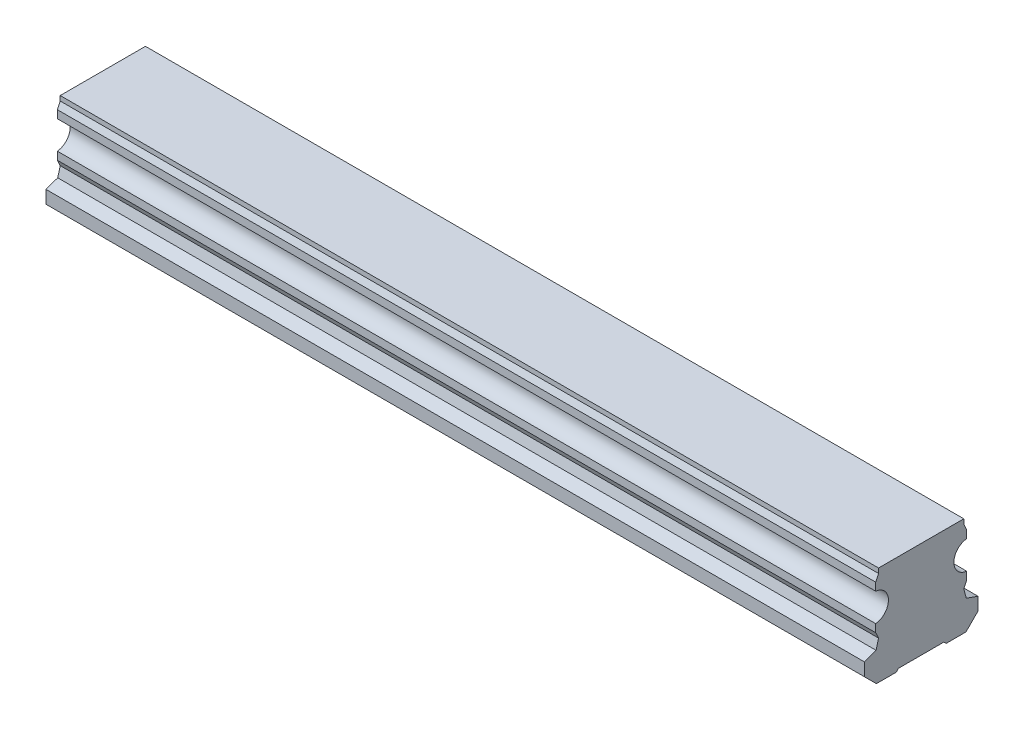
ISO-10303-21;
HEADER;
FILE_DESCRIPTION(('STEP AP214'),'2;1');
FILE_NAME('part.step','',(''),(''),'','','');
FILE_SCHEMA(('AUTOMOTIVE_DESIGN { 1 0 10303 214 1 1 1 1 }'));
ENDSEC;
DATA;
#1=APPLICATION_CONTEXT('core data for automotive mechanical design processes');
#2=APPLICATION_PROTOCOL_DEFINITION('international standard','automotive_design',2000,#1);
#3=PRODUCT_CONTEXT('',#1,'mechanical');
#4=PRODUCT('Part','Part','',(#3));
#5=PRODUCT_RELATED_PRODUCT_CATEGORY('part','',(#4));
#6=PRODUCT_DEFINITION_FORMATION('','',#4);
#7=PRODUCT_DEFINITION_CONTEXT('part definition',#1,'design');
#8=PRODUCT_DEFINITION('design','',#6,#7);
#9=PRODUCT_DEFINITION_SHAPE('','',#8);
#10=(LENGTH_UNIT() NAMED_UNIT(*) SI_UNIT(.MILLI.,.METRE.));
#11=(NAMED_UNIT(*) PLANE_ANGLE_UNIT() SI_UNIT($,.RADIAN.));
#12=(NAMED_UNIT(*) SI_UNIT($,.STERADIAN.) SOLID_ANGLE_UNIT());
#13=UNCERTAINTY_MEASURE_WITH_UNIT(LENGTH_MEASURE(1.E-05),#10,'distance_accuracy_value','');
#14=(GEOMETRIC_REPRESENTATION_CONTEXT(3) GLOBAL_UNCERTAINTY_ASSIGNED_CONTEXT((#13)) GLOBAL_UNIT_ASSIGNED_CONTEXT((#10,
#11,#12)) REPRESENTATION_CONTEXT('',''));
#15=CARTESIAN_POINT('',(0.,0.,0.));
#16=DIRECTION('',(0.,0.,1.));
#17=DIRECTION('',(1.,0.,0.));
#18=AXIS2_PLACEMENT_3D('',#15,#16,#17);
#19=CARTESIAN_POINT('',(150.,0.499999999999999,0.));
#20=DIRECTION('',(0.,-1.,0.));
#21=DIRECTION('',(0.,0.,-1.));
#22=AXIS2_PLACEMENT_3D('',#19,#20,#21);
#23=CONICAL_SURFACE('',#22,3.5,0.785398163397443);
#24=CARTESIAN_POINT('',(150.,1.00000000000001,0.));
#25=DIRECTION('',(0.,1.,0.));
#26=DIRECTION('',(0.,0.,1.));
#27=AXIS2_PLACEMENT_3D('',#24,#25,#26);
#28=CIRCLE('',#27,3.);
#29=CARTESIAN_POINT('',(150.,1.00000000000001,3.));
#30=VERTEX_POINT('',#29);
#31=EDGE_CURVE('E11',#30,#30,#28,.F.);
#32=ORIENTED_EDGE('',*,*,#31,.F.);
#33=EDGE_LOOP('',(#32));
#34=FACE_BOUND('',#33,.T.);
#35=CARTESIAN_POINT('',(150.,0.499999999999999,0.));
#36=DIRECTION('',(0.,1.,0.));
#37=DIRECTION('',(0.,0.,1.));
#38=AXIS2_PLACEMENT_3D('',#35,#36,#37);
#39=CIRCLE('',#38,3.5);
#40=CARTESIAN_POINT('',(150.,0.5,3.5));
#41=VERTEX_POINT('',#40);
#42=EDGE_CURVE('E433',#41,#41,#39,.T.);
#43=ORIENTED_EDGE('',*,*,#42,.F.);
#44=EDGE_LOOP('',(#43));
#45=FACE_BOUND('',#44,.T.);
#46=ADVANCED_FACE('F39',(#34,#45),#23,.F.);
#47=CARTESIAN_POINT('',(150.,12.,0.));
#48=DIRECTION('',(0.,-1.,0.));
#49=DIRECTION('',(0.,0.,-1.));
#50=AXIS2_PLACEMENT_3D('',#47,#48,#49);
#51=CYLINDRICAL_SURFACE('',#50,3.);
#52=ORIENTED_EDGE('',*,*,#31,.T.);
#53=EDGE_LOOP('',(#52));
#54=FACE_BOUND('',#53,.T.);
#55=CARTESIAN_POINT('',(150.,12.,0.));
#56=DIRECTION('',(0.,-1.,0.));
#57=DIRECTION('',(0.,0.,-1.));
#58=AXIS2_PLACEMENT_3D('',#55,#56,#57);
#59=CIRCLE('',#58,3.);
#60=CARTESIAN_POINT('',(150.,12.,-3.));
#61=VERTEX_POINT('',#60);
#62=EDGE_CURVE('E49',#61,#61,#59,.T.);
#63=ORIENTED_EDGE('',*,*,#62,.F.);
#64=EDGE_LOOP('',(#63));
#65=FACE_BOUND('',#64,.T.);
#66=ADVANCED_FACE('F573',(#54,#65),#51,.F.);
#67=CARTESIAN_POINT('',(150.,12.,0.));
#68=DIRECTION('',(0.,-1.,0.));
#69=DIRECTION('',(0.,0.,-1.));
#70=AXIS2_PLACEMENT_3D('',#67,#68,#69);
#71=PLANE('',#70);
#72=CARTESIAN_POINT('',(150.,12.,0.));
#73=DIRECTION('',(0.,-1.,0.));
#74=DIRECTION('',(0.,0.,-1.));
#75=AXIS2_PLACEMENT_3D('',#72,#73,#74);
#76=CIRCLE('',#75,2.5);
#77=CARTESIAN_POINT('',(150.,12.,-2.5));
#78=VERTEX_POINT('',#77);
#79=EDGE_CURVE('E42',#78,#78,#76,.T.);
#80=ORIENTED_EDGE('',*,*,#79,.F.);
#81=EDGE_LOOP('',(#80));
#82=FACE_BOUND('',#81,.T.);
#83=ORIENTED_EDGE('',*,*,#62,.T.);
#84=EDGE_LOOP('',(#83));
#85=FACE_BOUND('',#84,.T.);
#86=ADVANCED_FACE('F578',(#82,#85),#71,.T.);
#87=CARTESIAN_POINT('',(180.,21.8,-9.375));
#88=DIRECTION('',(0.,0.,1.));
#89=DIRECTION('',(0.,-1.,0.));
#90=AXIS2_PLACEMENT_3D('',#87,#88,#89);
#91=PLANE('',#90);
#92=DIRECTION('',(0.,1.,0.));
#93=VECTOR('',#92,1.);
#94=CARTESIAN_POINT('',(0.,21.8,-9.375));
#95=LINE('',#94,#93);
#96=CARTESIAN_POINT('',(0.,20.756,-9.375));
#97=VERTEX_POINT('',#96);
#98=CARTESIAN_POINT('',(0.,21.8,-9.375));
#99=VERTEX_POINT('',#98);
#100=EDGE_CURVE('E255',#97,#99,#95,.T.);
#101=ORIENTED_EDGE('',*,*,#100,.T.);
#102=DIRECTION('',(-1.,0.,0.));
#103=VECTOR('',#102,1.);
#104=CARTESIAN_POINT('',(180.,21.8,-9.375));
#105=LINE('',#104,#103);
#106=CARTESIAN_POINT('',(180.,21.8,-9.375));
#107=VERTEX_POINT('',#106);
#108=EDGE_CURVE('E423',#107,#99,#105,.T.);
#109=ORIENTED_EDGE('',*,*,#108,.F.);
#110=DIRECTION('',(0.,1.,0.));
#111=VECTOR('',#110,1.);
#112=CARTESIAN_POINT('',(180.,21.8,-9.375));
#113=LINE('',#112,#111);
#114=CARTESIAN_POINT('',(180.,20.756,-9.375));
#115=VERTEX_POINT('',#114);
#116=EDGE_CURVE('E332',#115,#107,#113,.T.);
#117=ORIENTED_EDGE('',*,*,#116,.F.);
#118=DIRECTION('',(-1.,0.,0.));
#119=VECTOR('',#118,1.);
#120=CARTESIAN_POINT('',(180.,20.756,-9.375));
#121=LINE('',#120,#119);
#122=EDGE_CURVE('E251',#115,#97,#121,.T.);
#123=ORIENTED_EDGE('',*,*,#122,.T.);
#124=EDGE_LOOP('',(#101,#109,#117,#123));
#125=FACE_BOUND('',#124,.T.);
#126=ADVANCED_FACE('F560',(#125),#91,.F.);
#127=CARTESIAN_POINT('',(180.,21.8,-9.375));
#128=DIRECTION('',(0.,-1.,0.));
#129=DIRECTION('',(0.,0.,-1.));
#130=AXIS2_PLACEMENT_3D('',#127,#128,#129);
#131=PLANE('',#130);
#132=DIRECTION('',(0.,0.,1.));
#133=VECTOR('',#132,1.);
#134=CARTESIAN_POINT('',(0.,21.8,-9.375));
#135=LINE('',#134,#133);
#136=CARTESIAN_POINT('',(0.,21.8,9.375));
#137=VERTEX_POINT('',#136);
#138=EDGE_CURVE('E259',#99,#137,#135,.T.);
#139=ORIENTED_EDGE('',*,*,#138,.T.);
#140=DIRECTION('',(-1.,0.,0.));
#141=VECTOR('',#140,1.);
#142=CARTESIAN_POINT('',(180.,21.8,9.375));
#143=LINE('',#142,#141);
#144=CARTESIAN_POINT('',(180.,21.8,9.375));
#145=VERTEX_POINT('',#144);
#146=EDGE_CURVE('E419',#145,#137,#143,.T.);
#147=ORIENTED_EDGE('',*,*,#146,.F.);
#148=DIRECTION('',(0.,0.,1.));
#149=VECTOR('',#148,1.);
#150=CARTESIAN_POINT('',(180.,21.8,-9.375));
#151=LINE('',#150,#149);
#152=EDGE_CURVE('E157',#107,#145,#151,.T.);
#153=ORIENTED_EDGE('',*,*,#152,.F.);
#154=ORIENTED_EDGE('',*,*,#108,.T.);
#155=EDGE_LOOP('',(#139,#147,#153,#154));
#156=FACE_BOUND('',#155,.T.);
#157=ADVANCED_FACE('F645',(#156),#131,.F.);
#158=CARTESIAN_POINT('',(180.,21.8,9.375));
#159=DIRECTION('',(0.,0.,-1.));
#160=DIRECTION('',(0.,1.,0.));
#161=AXIS2_PLACEMENT_3D('',#158,#159,#160);
#162=PLANE('',#161);
#163=DIRECTION('',(0.,-1.,0.));
#164=VECTOR('',#163,1.);
#165=CARTESIAN_POINT('',(0.,21.8,9.375));
#166=LINE('',#165,#164);
#167=CARTESIAN_POINT('',(0.,20.756,9.37499999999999));
#168=VERTEX_POINT('',#167);
#169=EDGE_CURVE('E263',#137,#168,#166,.T.);
#170=ORIENTED_EDGE('',*,*,#169,.T.);
#171=DIRECTION('',(-1.,0.,0.));
#172=VECTOR('',#171,1.);
#173=CARTESIAN_POINT('',(180.,20.756,9.37499999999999));
#174=LINE('',#173,#172);
#175=CARTESIAN_POINT('',(180.,20.756,9.37499999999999));
#176=VERTEX_POINT('',#175);
#177=EDGE_CURVE('E415',#176,#168,#174,.T.);
#178=ORIENTED_EDGE('',*,*,#177,.F.);
#179=DIRECTION('',(0.,-1.,0.));
#180=VECTOR('',#179,1.);
#181=CARTESIAN_POINT('',(180.,21.8,9.375));
#182=LINE('',#181,#180);
#183=EDGE_CURVE('E485',#145,#176,#182,.T.);
#184=ORIENTED_EDGE('',*,*,#183,.F.);
#185=ORIENTED_EDGE('',*,*,#146,.T.);
#186=EDGE_LOOP('',(#170,#178,#184,#185));
#187=FACE_BOUND('',#186,.T.);
#188=ADVANCED_FACE('F641',(#187),#162,.F.);
#189=CARTESIAN_POINT('',(180.,20.756,9.37499999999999));
#190=DIRECTION('',(0.,-0.422618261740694,-0.906307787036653));
#191=DIRECTION('',(0.,0.906307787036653,-0.422618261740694));
#192=AXIS2_PLACEMENT_3D('',#189,#190,#191);
#193=PLANE('',#192);
#194=DIRECTION('',(0.,-0.906307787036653,0.422618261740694));
#195=VECTOR('',#194,1.);
#196=CARTESIAN_POINT('',(0.,20.756,9.37499999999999));
#197=LINE('',#196,#195);
#198=CARTESIAN_POINT('',(0.,19.4156831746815,10.));
#199=VERTEX_POINT('',#198);
#200=EDGE_CURVE('E266',#168,#199,#197,.T.);
#201=ORIENTED_EDGE('',*,*,#200,.T.);
#202=DIRECTION('',(-1.,0.,0.));
#203=VECTOR('',#202,1.);
#204=CARTESIAN_POINT('',(180.,19.4156831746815,10.));
#205=LINE('',#204,#203);
#206=CARTESIAN_POINT('',(180.,19.4156831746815,10.));
#207=VERTEX_POINT('',#206);
#208=EDGE_CURVE('E411',#207,#199,#205,.T.);
#209=ORIENTED_EDGE('',*,*,#208,.F.);
#210=DIRECTION('',(0.,-0.906307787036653,0.422618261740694));
#211=VECTOR('',#210,1.);
#212=CARTESIAN_POINT('',(180.,20.756,9.37499999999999));
#213=LINE('',#212,#211);
#214=EDGE_CURVE('E488',#176,#207,#213,.T.);
#215=ORIENTED_EDGE('',*,*,#214,.F.);
#216=ORIENTED_EDGE('',*,*,#177,.T.);
#217=EDGE_LOOP('',(#201,#209,#215,#216));
#218=FACE_BOUND('',#217,.T.);
#219=ADVANCED_FACE('F637',(#218),#193,.F.);
#220=CARTESIAN_POINT('',(180.,19.4156831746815,10.));
#221=DIRECTION('',(0.,0.,-1.));
#222=DIRECTION('',(-1.,0.,0.));
#223=AXIS2_PLACEMENT_3D('',#220,#221,#222);
#224=PLANE('',#223);
#225=DIRECTION('',(0.,-1.,0.));
#226=VECTOR('',#225,1.);
#227=CARTESIAN_POINT('',(0.,19.4156831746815,10.));
#228=LINE('',#227,#226);
#229=CARTESIAN_POINT('',(0.,17.6854497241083,10.));
#230=VERTEX_POINT('',#229);
#231=EDGE_CURVE('E269',#199,#230,#228,.T.);
#232=ORIENTED_EDGE('',*,*,#231,.T.);
#233=DIRECTION('',(-1.,0.,0.));
#234=VECTOR('',#233,1.);
#235=CARTESIAN_POINT('',(180.,17.6854497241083,10.));
#236=LINE('',#235,#234);
#237=CARTESIAN_POINT('',(180.,17.6854497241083,10.));
#238=VERTEX_POINT('',#237);
#239=EDGE_CURVE('E407',#238,#230,#236,.T.);
#240=ORIENTED_EDGE('',*,*,#239,.F.);
#241=DIRECTION('',(0.,-1.,0.));
#242=VECTOR('',#241,1.);
#243=CARTESIAN_POINT('',(180.,19.4156831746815,10.));
#244=LINE('',#243,#242);
#245=EDGE_CURVE('E491',#207,#238,#244,.T.);
#246=ORIENTED_EDGE('',*,*,#245,.F.);
#247=ORIENTED_EDGE('',*,*,#208,.T.);
#248=EDGE_LOOP('',(#232,#240,#246,#247));
#249=FACE_BOUND('',#248,.T.);
#250=ADVANCED_FACE('F633',(#249),#224,.F.);
#251=CARTESIAN_POINT('',(180.,14.6,10.3));
#252=DIRECTION('',(-1.,0.,0.));
#253=DIRECTION('',(0.,0.,1.));
#254=AXIS2_PLACEMENT_3D('',#251,#252,#253);
#255=CYLINDRICAL_SURFACE('',#254,3.1);
#256=CARTESIAN_POINT('',(0.,14.6,10.3));
#257=DIRECTION('',(-1.,0.,0.));
#258=DIRECTION('',(0.,0.,-1.));
#259=AXIS2_PLACEMENT_3D('',#256,#257,#258);
#260=CIRCLE('',#259,3.1);
#261=CARTESIAN_POINT('',(0.,11.5145502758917,10.));
#262=VERTEX_POINT('',#261);
#263=EDGE_CURVE('E272',#230,#262,#260,.T.);
#264=ORIENTED_EDGE('',*,*,#263,.T.);
#265=DIRECTION('',(-1.,0.,0.));
#266=VECTOR('',#265,1.);
#267=CARTESIAN_POINT('',(180.,11.5145502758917,10.));
#268=LINE('',#267,#266);
#269=CARTESIAN_POINT('',(180.,11.5145502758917,10.));
#270=VERTEX_POINT('',#269);
#271=EDGE_CURVE('E403',#270,#262,#268,.T.);
#272=ORIENTED_EDGE('',*,*,#271,.F.);
#273=CARTESIAN_POINT('',(180.,14.6,10.3));
#274=DIRECTION('',(-1.,0.,0.));
#275=DIRECTION('',(0.,0.,-1.));
#276=AXIS2_PLACEMENT_3D('',#273,#274,#275);
#277=CIRCLE('',#276,3.1);
#278=EDGE_CURVE('E494',#238,#270,#277,.T.);
#279=ORIENTED_EDGE('',*,*,#278,.F.);
#280=ORIENTED_EDGE('',*,*,#239,.T.);
#281=EDGE_LOOP('',(#264,#272,#279,#280));
#282=FACE_BOUND('',#281,.T.);
#283=ADVANCED_FACE('F629',(#282),#255,.F.);
#284=CARTESIAN_POINT('',(180.,9.78431682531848,10.));
#285=DIRECTION('',(0.,0.,-1.));
#286=DIRECTION('',(0.,1.,0.));
#287=AXIS2_PLACEMENT_3D('',#284,#285,#286);
#288=PLANE('',#287);
#289=DIRECTION('',(0.,-1.,0.));
#290=VECTOR('',#289,1.);
#291=CARTESIAN_POINT('',(0.,9.78431682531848,10.));
#292=LINE('',#291,#290);
#293=CARTESIAN_POINT('',(0.,9.78431682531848,10.));
#294=VERTEX_POINT('',#293);
#295=EDGE_CURVE('E275',#262,#294,#292,.T.);
#296=ORIENTED_EDGE('',*,*,#295,.T.);
#297=DIRECTION('',(-1.,0.,0.));
#298=VECTOR('',#297,1.);
#299=CARTESIAN_POINT('',(180.,9.78431682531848,10.));
#300=LINE('',#299,#298);
#301=CARTESIAN_POINT('',(180.,9.78431682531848,10.));
#302=VERTEX_POINT('',#301);
#303=EDGE_CURVE('E399',#302,#294,#300,.T.);
#304=ORIENTED_EDGE('',*,*,#303,.F.);
#305=DIRECTION('',(0.,-1.,0.));
#306=VECTOR('',#305,1.);
#307=CARTESIAN_POINT('',(180.,9.78431682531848,10.));
#308=LINE('',#307,#306);
#309=EDGE_CURVE('E497',#270,#302,#308,.T.);
#310=ORIENTED_EDGE('',*,*,#309,.F.);
#311=ORIENTED_EDGE('',*,*,#271,.T.);
#312=EDGE_LOOP('',(#296,#304,#310,#311));
#313=FACE_BOUND('',#312,.T.);
#314=ADVANCED_FACE('F625',(#313),#288,.F.);
#315=CARTESIAN_POINT('',(180.,8.44400000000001,9.375));
#316=DIRECTION('',(0.,0.4226182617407,-0.90630778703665));
#317=DIRECTION('',(0.,0.90630778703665,0.4226182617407));
#318=AXIS2_PLACEMENT_3D('',#315,#316,#317);
#319=PLANE('',#318);
#320=DIRECTION('',(0.,-0.90630778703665,-0.4226182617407));
#321=VECTOR('',#320,1.);
#322=CARTESIAN_POINT('',(0.,8.44400000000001,9.375));
#323=LINE('',#322,#321);
#324=CARTESIAN_POINT('',(0.,8.44400000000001,9.375));
#325=VERTEX_POINT('',#324);
#326=EDGE_CURVE('E278',#294,#325,#323,.T.);
#327=ORIENTED_EDGE('',*,*,#326,.T.);
#328=DIRECTION('',(-1.,0.,0.));
#329=VECTOR('',#328,1.);
#330=CARTESIAN_POINT('',(180.,8.44400000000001,9.375));
#331=LINE('',#330,#329);
#332=CARTESIAN_POINT('',(180.,8.44400000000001,9.375));
#333=VERTEX_POINT('',#332);
#334=EDGE_CURVE('E395',#333,#325,#331,.T.);
#335=ORIENTED_EDGE('',*,*,#334,.F.);
#336=DIRECTION('',(0.,-0.90630778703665,-0.4226182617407));
#337=VECTOR('',#336,1.);
#338=CARTESIAN_POINT('',(180.,8.44400000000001,9.375));
#339=LINE('',#338,#337);
#340=EDGE_CURVE('E500',#302,#333,#339,.T.);
#341=ORIENTED_EDGE('',*,*,#340,.F.);
#342=ORIENTED_EDGE('',*,*,#303,.T.);
#343=EDGE_LOOP('',(#327,#335,#341,#342));
#344=FACE_BOUND('',#343,.T.);
#345=ADVANCED_FACE('F621',(#344),#319,.F.);
#346=CARTESIAN_POINT('',(180.,6.4,9.92268814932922));
#347=DIRECTION('',(0.,-0.258819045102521,-0.965925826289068));
#348=DIRECTION('',(0.,0.965925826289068,-0.258819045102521));
#349=AXIS2_PLACEMENT_3D('',#346,#347,#348);
#350=PLANE('',#349);
#351=DIRECTION('',(0.,-0.965925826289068,0.258819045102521));
#352=VECTOR('',#351,1.);
#353=CARTESIAN_POINT('',(0.,6.4,9.92268814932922));
#354=LINE('',#353,#352);
#355=CARTESIAN_POINT('',(0.,6.4,9.92268814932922));
#356=VERTEX_POINT('',#355);
#357=EDGE_CURVE('E281',#325,#356,#354,.T.);
#358=ORIENTED_EDGE('',*,*,#357,.T.);
#359=DIRECTION('',(-1.,0.,0.));
#360=VECTOR('',#359,1.);
#361=CARTESIAN_POINT('',(180.,6.4,9.92268814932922));
#362=LINE('',#361,#360);
#363=CARTESIAN_POINT('',(180.,6.4,9.92268814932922));
#364=VERTEX_POINT('',#363);
#365=EDGE_CURVE('E391',#364,#356,#362,.T.);
#366=ORIENTED_EDGE('',*,*,#365,.F.);
#367=DIRECTION('',(0.,-0.965925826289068,0.258819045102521));
#368=VECTOR('',#367,1.);
#369=CARTESIAN_POINT('',(180.,6.4,9.92268814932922));
#370=LINE('',#369,#368);
#371=EDGE_CURVE('E503',#333,#364,#370,.T.);
#372=ORIENTED_EDGE('',*,*,#371,.F.);
#373=ORIENTED_EDGE('',*,*,#334,.T.);
#374=EDGE_LOOP('',(#358,#366,#372,#373));
#375=FACE_BOUND('',#374,.T.);
#376=ADVANCED_FACE('F617',(#375),#350,.F.);
#377=CARTESIAN_POINT('',(180.,5.48933857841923,12.5));
#378=DIRECTION('',(0.,-0.942872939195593,-0.333152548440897));
#379=DIRECTION('',(0.,0.333152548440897,-0.942872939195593));
#380=AXIS2_PLACEMENT_3D('',#377,#378,#379);
#381=PLANE('',#380);
#382=DIRECTION('',(0.,-0.333152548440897,0.942872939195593));
#383=VECTOR('',#382,1.);
#384=CARTESIAN_POINT('',(0.,5.48933857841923,12.5));
#385=LINE('',#384,#383);
#386=CARTESIAN_POINT('',(0.,5.48933857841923,12.5));
#387=VERTEX_POINT('',#386);
#388=EDGE_CURVE('E284',#356,#387,#385,.T.);
#389=ORIENTED_EDGE('',*,*,#388,.T.);
#390=DIRECTION('',(-1.,0.,0.));
#391=VECTOR('',#390,1.);
#392=CARTESIAN_POINT('',(180.,5.48933857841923,12.5));
#393=LINE('',#392,#391);
#394=CARTESIAN_POINT('',(180.,5.48933857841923,12.5));
#395=VERTEX_POINT('',#394);
#396=EDGE_CURVE('E387',#395,#387,#393,.T.);
#397=ORIENTED_EDGE('',*,*,#396,.F.);
#398=DIRECTION('',(0.,-0.333152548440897,0.942872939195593));
#399=VECTOR('',#398,1.);
#400=CARTESIAN_POINT('',(180.,5.48933857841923,12.5));
#401=LINE('',#400,#399);
#402=EDGE_CURVE('E506',#364,#395,#401,.T.);
#403=ORIENTED_EDGE('',*,*,#402,.F.);
#404=ORIENTED_EDGE('',*,*,#365,.T.);
#405=EDGE_LOOP('',(#389,#397,#403,#404));
#406=FACE_BOUND('',#405,.T.);
#407=ADVANCED_FACE('F613',(#406),#381,.F.);
#408=CARTESIAN_POINT('',(180.,2.65,12.5));
#409=DIRECTION('',(0.,0.,-1.));
#410=DIRECTION('',(0.,1.,0.));
#411=AXIS2_PLACEMENT_3D('',#408,#409,#410);
#412=PLANE('',#411);
#413=DIRECTION('',(0.,-1.,0.));
#414=VECTOR('',#413,1.);
#415=CARTESIAN_POINT('',(0.,2.65,12.5));
#416=LINE('',#415,#414);
#417=CARTESIAN_POINT('',(0.,2.65,12.5));
#418=VERTEX_POINT('',#417);
#419=EDGE_CURVE('E287',#387,#418,#416,.T.);
#420=ORIENTED_EDGE('',*,*,#419,.T.);
#421=DIRECTION('',(-1.,0.,0.));
#422=VECTOR('',#421,1.);
#423=CARTESIAN_POINT('',(180.,2.65,12.5));
#424=LINE('',#423,#422);
#425=CARTESIAN_POINT('',(180.,2.65,12.5));
#426=VERTEX_POINT('',#425);
#427=EDGE_CURVE('E383',#426,#418,#424,.T.);
#428=ORIENTED_EDGE('',*,*,#427,.F.);
#429=DIRECTION('',(0.,-1.,0.));
#430=VECTOR('',#429,1.);
#431=CARTESIAN_POINT('',(180.,2.65,12.5));
#432=LINE('',#431,#430);
#433=EDGE_CURVE('E509',#395,#426,#432,.T.);
#434=ORIENTED_EDGE('',*,*,#433,.F.);
#435=ORIENTED_EDGE('',*,*,#396,.T.);
#436=EDGE_LOOP('',(#420,#428,#434,#435));
#437=FACE_BOUND('',#436,.T.);
#438=ADVANCED_FACE('F609',(#437),#412,.F.);
#439=CARTESIAN_POINT('',(180.,0.,9.85));
#440=DIRECTION('',(0.,0.707106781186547,-0.707106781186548));
#441=DIRECTION('',(0.,0.707106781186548,0.707106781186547));
#442=AXIS2_PLACEMENT_3D('',#439,#440,#441);
#443=PLANE('',#442);
#444=DIRECTION('',(0.,-0.707106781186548,-0.707106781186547));
#445=VECTOR('',#444,1.);
#446=CARTESIAN_POINT('',(0.,0.,9.85));
#447=LINE('',#446,#445);
#448=CARTESIAN_POINT('',(0.,0.,9.85));
#449=VERTEX_POINT('',#448);
#450=EDGE_CURVE('E290',#418,#449,#447,.T.);
#451=ORIENTED_EDGE('',*,*,#450,.T.);
#452=DIRECTION('',(-1.,0.,0.));
#453=VECTOR('',#452,1.);
#454=CARTESIAN_POINT('',(180.,0.,9.85));
#455=LINE('',#454,#453);
#456=CARTESIAN_POINT('',(180.,0.,9.85));
#457=VERTEX_POINT('',#456);
#458=EDGE_CURVE('E379',#457,#449,#455,.T.);
#459=ORIENTED_EDGE('',*,*,#458,.F.);
#460=DIRECTION('',(0.,-0.707106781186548,-0.707106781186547));
#461=VECTOR('',#460,1.);
#462=CARTESIAN_POINT('',(180.,0.,9.85));
#463=LINE('',#462,#461);
#464=EDGE_CURVE('E512',#426,#457,#463,.T.);
#465=ORIENTED_EDGE('',*,*,#464,.F.);
#466=ORIENTED_EDGE('',*,*,#427,.T.);
#467=EDGE_LOOP('',(#451,#459,#465,#466));
#468=FACE_BOUND('',#467,.T.);
#469=ADVANCED_FACE('F605',(#468),#443,.F.);
#470=CARTESIAN_POINT('',(180.,0.,5.5));
#471=DIRECTION('',(0.,1.,0.));
#472=DIRECTION('',(0.,0.,1.));
#473=AXIS2_PLACEMENT_3D('',#470,#471,#472);
#474=PLANE('',#473);
#475=DIRECTION('',(0.,0.,-1.));
#476=VECTOR('',#475,1.);
#477=CARTESIAN_POINT('',(0.,0.,5.5));
#478=LINE('',#477,#476);
#479=CARTESIAN_POINT('',(0.,0.,5.5));
#480=VERTEX_POINT('',#479);
#481=EDGE_CURVE('E293',#449,#480,#478,.T.);
#482=ORIENTED_EDGE('',*,*,#481,.T.);
#483=DIRECTION('',(-1.,0.,0.));
#484=VECTOR('',#483,1.);
#485=CARTESIAN_POINT('',(180.,0.,5.5));
#486=LINE('',#485,#484);
#487=CARTESIAN_POINT('',(180.,0.,5.5));
#488=VERTEX_POINT('',#487);
#489=EDGE_CURVE('E375',#488,#480,#486,.T.);
#490=ORIENTED_EDGE('',*,*,#489,.F.);
#491=DIRECTION('',(0.,0.,-1.));
#492=VECTOR('',#491,1.);
#493=CARTESIAN_POINT('',(180.,0.,5.5));
#494=LINE('',#493,#492);
#495=EDGE_CURVE('E515',#457,#488,#494,.T.);
#496=ORIENTED_EDGE('',*,*,#495,.F.);
#497=ORIENTED_EDGE('',*,*,#458,.T.);
#498=EDGE_LOOP('',(#482,#490,#496,#497));
#499=FACE_BOUND('',#498,.T.);
#500=ADVANCED_FACE('F597',(#499),#474,.F.);
#501=CARTESIAN_POINT('',(180.,0.5,5.));
#502=DIRECTION('',(0.,0.707106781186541,0.707106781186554));
#503=DIRECTION('',(0.,-0.707106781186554,0.707106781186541));
#504=AXIS2_PLACEMENT_3D('',#501,#502,#503);
#505=PLANE('',#504);
#506=DIRECTION('',(0.,0.707106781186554,-0.707106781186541));
#507=VECTOR('',#506,1.);
#508=CARTESIAN_POINT('',(0.,0.5,5.));
#509=LINE('',#508,#507);
#510=CARTESIAN_POINT('',(0.,0.5,5.));
#511=VERTEX_POINT('',#510);
#512=EDGE_CURVE('E296',#480,#511,#509,.T.);
#513=ORIENTED_EDGE('',*,*,#512,.T.);
#514=DIRECTION('',(-1.,0.,0.));
#515=VECTOR('',#514,1.);
#516=CARTESIAN_POINT('',(180.,0.5,5.));
#517=LINE('',#516,#515);
#518=CARTESIAN_POINT('',(180.,0.5,5.));
#519=VERTEX_POINT('',#518);
#520=EDGE_CURVE('E371',#519,#511,#517,.T.);
#521=ORIENTED_EDGE('',*,*,#520,.F.);
#522=DIRECTION('',(0.,0.707106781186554,-0.707106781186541));
#523=VECTOR('',#522,1.);
#524=CARTESIAN_POINT('',(180.,0.5,5.));
#525=LINE('',#524,#523);
#526=EDGE_CURVE('E518',#488,#519,#525,.T.);
#527=ORIENTED_EDGE('',*,*,#526,.F.);
#528=ORIENTED_EDGE('',*,*,#489,.T.);
#529=EDGE_LOOP('',(#513,#521,#527,#528));
#530=FACE_BOUND('',#529,.T.);
#531=ADVANCED_FACE('F587',(#530),#505,.F.);
#532=CARTESIAN_POINT('',(180.,0.499999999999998,-5.));
#533=DIRECTION('',(0.,1.,0.));
#534=DIRECTION('',(0.,0.,1.));
#535=AXIS2_PLACEMENT_3D('',#532,#533,#534);
#536=PLANE('',#535);
#537=CARTESIAN_POINT('',(90.,0.499999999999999,0.));
#538=DIRECTION('',(0.,1.,0.));
#539=DIRECTION('',(0.,0.,1.));
#540=AXIS2_PLACEMENT_3D('',#537,#538,#539);
#541=CIRCLE('',#540,3.5);
#542=CARTESIAN_POINT('',(90.,0.5,3.5));
#543=VERTEX_POINT('',#542);
#544=EDGE_CURVE('E448',#543,#543,#541,.T.);
#545=ORIENTED_EDGE('',*,*,#544,.T.);
#546=EDGE_LOOP('',(#545));
#547=FACE_BOUND('',#546,.T.);
#548=CARTESIAN_POINT('',(30.,0.499999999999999,0.));
#549=DIRECTION('',(0.,1.,0.));
#550=DIRECTION('',(0.,0.,1.));
#551=AXIS2_PLACEMENT_3D('',#548,#549,#550);
#552=CIRCLE('',#551,3.5);
#553=CARTESIAN_POINT('',(30.,0.5,3.5));
#554=VERTEX_POINT('',#553);
#555=EDGE_CURVE('E426',#554,#554,#552,.T.);
#556=ORIENTED_EDGE('',*,*,#555,.T.);
#557=EDGE_LOOP('',(#556));
#558=FACE_BOUND('',#557,.T.);
#559=DIRECTION('',(0.,0.,-1.));
#560=VECTOR('',#559,1.);
#561=CARTESIAN_POINT('',(0.,0.499999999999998,-5.));
#562=LINE('',#561,#560);
#563=CARTESIAN_POINT('',(0.,0.499999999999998,-5.));
#564=VERTEX_POINT('',#563);
#565=EDGE_CURVE('E299',#511,#564,#562,.T.);
#566=ORIENTED_EDGE('',*,*,#565,.T.);
#567=DIRECTION('',(-1.,0.,0.));
#568=VECTOR('',#567,1.);
#569=CARTESIAN_POINT('',(180.,0.499999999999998,-5.));
#570=LINE('',#569,#568);
#571=CARTESIAN_POINT('',(180.,0.499999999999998,-5.));
#572=VERTEX_POINT('',#571);
#573=EDGE_CURVE('E367',#572,#564,#570,.T.);
#574=ORIENTED_EDGE('',*,*,#573,.F.);
#575=DIRECTION('',(0.,0.,-1.));
#576=VECTOR('',#575,1.);
#577=CARTESIAN_POINT('',(180.,0.499999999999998,-5.));
#578=LINE('',#577,#576);
#579=EDGE_CURVE('E520',#519,#572,#578,.T.);
#580=ORIENTED_EDGE('',*,*,#579,.F.);
#581=ORIENTED_EDGE('',*,*,#520,.T.);
#582=EDGE_LOOP('',(#566,#574,#580,#581));
#583=FACE_BOUND('',#582,.T.);
#584=ORIENTED_EDGE('',*,*,#42,.T.);
#585=EDGE_LOOP('',(#584));
#586=FACE_BOUND('',#585,.T.);
#587=ADVANCED_FACE('F584',(#547,#558,#583,#586),#536,.F.);
#588=CARTESIAN_POINT('',(180.,0.,-5.5));
#589=DIRECTION('',(0.,0.707106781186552,-0.707106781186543));
#590=DIRECTION('',(0.,0.707106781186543,0.707106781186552));
#591=AXIS2_PLACEMENT_3D('',#588,#589,#590);
#592=PLANE('',#591);
#593=DIRECTION('',(0.,-0.707106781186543,-0.707106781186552));
#594=VECTOR('',#593,1.);
#595=CARTESIAN_POINT('',(0.,0.,-5.5));
#596=LINE('',#595,#594);
#597=CARTESIAN_POINT('',(0.,0.,-5.5));
#598=VERTEX_POINT('',#597);
#599=EDGE_CURVE('E302',#564,#598,#596,.T.);
#600=ORIENTED_EDGE('',*,*,#599,.T.);
#601=DIRECTION('',(-1.,0.,0.));
#602=VECTOR('',#601,1.);
#603=CARTESIAN_POINT('',(180.,0.,-5.5));
#604=LINE('',#603,#602);
#605=CARTESIAN_POINT('',(180.,0.,-5.5));
#606=VERTEX_POINT('',#605);
#607=EDGE_CURVE('E363',#606,#598,#604,.T.);
#608=ORIENTED_EDGE('',*,*,#607,.F.);
#609=DIRECTION('',(0.,-0.707106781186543,-0.707106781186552));
#610=VECTOR('',#609,1.);
#611=CARTESIAN_POINT('',(180.,0.,-5.5));
#612=LINE('',#611,#610);
#613=EDGE_CURVE('E523',#572,#606,#612,.T.);
#614=ORIENTED_EDGE('',*,*,#613,.F.);
#615=ORIENTED_EDGE('',*,*,#573,.T.);
#616=EDGE_LOOP('',(#600,#608,#614,#615));
#617=FACE_BOUND('',#616,.T.);
#618=ADVANCED_FACE('F586',(#617),#592,.F.);
#619=CARTESIAN_POINT('',(180.,0.,-9.85));
#620=DIRECTION('',(0.,1.,0.));
#621=DIRECTION('',(0.,0.,1.));
#622=AXIS2_PLACEMENT_3D('',#619,#620,#621);
#623=PLANE('',#622);
#624=DIRECTION('',(0.,0.,-1.));
#625=VECTOR('',#624,1.);
#626=CARTESIAN_POINT('',(0.,0.,-9.85));
#627=LINE('',#626,#625);
#628=CARTESIAN_POINT('',(0.,0.,-9.85));
#629=VERTEX_POINT('',#628);
#630=EDGE_CURVE('E305',#598,#629,#627,.T.);
#631=ORIENTED_EDGE('',*,*,#630,.T.);
#632=DIRECTION('',(-1.,0.,0.));
#633=VECTOR('',#632,1.);
#634=CARTESIAN_POINT('',(180.,0.,-9.85));
#635=LINE('',#634,#633);
#636=CARTESIAN_POINT('',(180.,0.,-9.85));
#637=VERTEX_POINT('',#636);
#638=EDGE_CURVE('E359',#637,#629,#635,.T.);
#639=ORIENTED_EDGE('',*,*,#638,.F.);
#640=DIRECTION('',(0.,0.,-1.));
#641=VECTOR('',#640,1.);
#642=CARTESIAN_POINT('',(180.,0.,-9.85));
#643=LINE('',#642,#641);
#644=EDGE_CURVE('E526',#606,#637,#643,.T.);
#645=ORIENTED_EDGE('',*,*,#644,.F.);
#646=ORIENTED_EDGE('',*,*,#607,.T.);
#647=EDGE_LOOP('',(#631,#639,#645,#646));
#648=FACE_BOUND('',#647,.T.);
#649=ADVANCED_FACE('F594',(#648),#623,.F.);
#650=CARTESIAN_POINT('',(180.,2.65,-12.5));
#651=DIRECTION('',(0.,0.707106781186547,0.707106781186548));
#652=DIRECTION('',(0.,-0.707106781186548,0.707106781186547));
#653=AXIS2_PLACEMENT_3D('',#650,#651,#652);
#654=PLANE('',#653);
#655=DIRECTION('',(0.,0.707106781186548,-0.707106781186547));
#656=VECTOR('',#655,1.);
#657=CARTESIAN_POINT('',(0.,2.65,-12.5));
#658=LINE('',#657,#656);
#659=CARTESIAN_POINT('',(0.,2.65,-12.5));
#660=VERTEX_POINT('',#659);
#661=EDGE_CURVE('E308',#629,#660,#658,.T.);
#662=ORIENTED_EDGE('',*,*,#661,.T.);
#663=DIRECTION('',(-1.,0.,0.));
#664=VECTOR('',#663,1.);
#665=CARTESIAN_POINT('',(180.,2.65,-12.5));
#666=LINE('',#665,#664);
#667=CARTESIAN_POINT('',(180.,2.65,-12.5));
#668=VERTEX_POINT('',#667);
#669=EDGE_CURVE('E355',#668,#660,#666,.T.);
#670=ORIENTED_EDGE('',*,*,#669,.F.);
#671=DIRECTION('',(0.,0.707106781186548,-0.707106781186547));
#672=VECTOR('',#671,1.);
#673=CARTESIAN_POINT('',(180.,2.65,-12.5));
#674=LINE('',#673,#672);
#675=EDGE_CURVE('E529',#637,#668,#674,.T.);
#676=ORIENTED_EDGE('',*,*,#675,.F.);
#677=ORIENTED_EDGE('',*,*,#638,.T.);
#678=EDGE_LOOP('',(#662,#670,#676,#677));
#679=FACE_BOUND('',#678,.T.);
#680=ADVANCED_FACE('F888',(#679),#654,.F.);
#681=CARTESIAN_POINT('',(180.,5.48933857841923,-12.5));
#682=DIRECTION('',(0.,0.,1.));
#683=DIRECTION('',(0.,-1.,0.));
#684=AXIS2_PLACEMENT_3D('',#681,#682,#683);
#685=PLANE('',#684);
#686=DIRECTION('',(0.,1.,0.));
#687=VECTOR('',#686,1.);
#688=CARTESIAN_POINT('',(0.,5.48933857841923,-12.5));
#689=LINE('',#688,#687);
#690=CARTESIAN_POINT('',(0.,5.48933857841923,-12.5));
#691=VERTEX_POINT('',#690);
#692=EDGE_CURVE('E311',#660,#691,#689,.T.);
#693=ORIENTED_EDGE('',*,*,#692,.T.);
#694=DIRECTION('',(-1.,0.,0.));
#695=VECTOR('',#694,1.);
#696=CARTESIAN_POINT('',(180.,5.48933857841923,-12.5));
#697=LINE('',#696,#695);
#698=CARTESIAN_POINT('',(180.,5.48933857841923,-12.5));
#699=VERTEX_POINT('',#698);
#700=EDGE_CURVE('E351',#699,#691,#697,.T.);
#701=ORIENTED_EDGE('',*,*,#700,.F.);
#702=DIRECTION('',(0.,1.,0.));
#703=VECTOR('',#702,1.);
#704=CARTESIAN_POINT('',(180.,5.48933857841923,-12.5));
#705=LINE('',#704,#703);
#706=EDGE_CURVE('E532',#668,#699,#705,.T.);
#707=ORIENTED_EDGE('',*,*,#706,.F.);
#708=ORIENTED_EDGE('',*,*,#669,.T.);
#709=EDGE_LOOP('',(#693,#701,#707,#708));
#710=FACE_BOUND('',#709,.T.);
#711=ADVANCED_FACE('F878',(#710),#685,.F.);
#712=CARTESIAN_POINT('',(180.,6.39999999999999,-9.92268814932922));
#713=DIRECTION('',(0.,-0.942872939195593,0.333152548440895));
#714=DIRECTION('',(0.,-0.333152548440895,-0.942872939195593));
#715=AXIS2_PLACEMENT_3D('',#712,#713,#714);
#716=PLANE('',#715);
#717=DIRECTION('',(0.,0.333152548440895,0.942872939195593));
#718=VECTOR('',#717,1.);
#719=CARTESIAN_POINT('',(0.,6.39999999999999,-9.92268814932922));
#720=LINE('',#719,#718);
#721=CARTESIAN_POINT('',(0.,6.39999999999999,-9.92268814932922));
#722=VERTEX_POINT('',#721);
#723=EDGE_CURVE('E314',#691,#722,#720,.T.);
#724=ORIENTED_EDGE('',*,*,#723,.T.);
#725=DIRECTION('',(-1.,0.,0.));
#726=VECTOR('',#725,1.);
#727=CARTESIAN_POINT('',(180.,6.39999999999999,-9.92268814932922));
#728=LINE('',#727,#726);
#729=CARTESIAN_POINT('',(180.,6.39999999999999,-9.92268814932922));
#730=VERTEX_POINT('',#729);
#731=EDGE_CURVE('E347',#730,#722,#728,.T.);
#732=ORIENTED_EDGE('',*,*,#731,.F.);
#733=DIRECTION('',(0.,0.333152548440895,0.942872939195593));
#734=VECTOR('',#733,1.);
#735=CARTESIAN_POINT('',(180.,6.39999999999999,-9.92268814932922));
#736=LINE('',#735,#734);
#737=EDGE_CURVE('E535',#699,#730,#736,.T.);
#738=ORIENTED_EDGE('',*,*,#737,.F.);
#739=ORIENTED_EDGE('',*,*,#700,.T.);
#740=EDGE_LOOP('',(#724,#732,#738,#739));
#741=FACE_BOUND('',#740,.T.);
#742=ADVANCED_FACE('F868',(#741),#716,.F.);
#743=CARTESIAN_POINT('',(180.,8.44400000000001,-9.375));
#744=DIRECTION('',(0.,-0.258819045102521,0.965925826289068));
#745=DIRECTION('',(0.,-0.965925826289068,-0.258819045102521));
#746=AXIS2_PLACEMENT_3D('',#743,#744,#745);
#747=PLANE('',#746);
#748=DIRECTION('',(0.,0.965925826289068,0.258819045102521));
#749=VECTOR('',#748,1.);
#750=CARTESIAN_POINT('',(0.,8.44400000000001,-9.375));
#751=LINE('',#750,#749);
#752=CARTESIAN_POINT('',(0.,8.44400000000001,-9.375));
#753=VERTEX_POINT('',#752);
#754=EDGE_CURVE('E317',#722,#753,#751,.T.);
#755=ORIENTED_EDGE('',*,*,#754,.T.);
#756=DIRECTION('',(-1.,0.,0.));
#757=VECTOR('',#756,1.);
#758=CARTESIAN_POINT('',(180.,8.44400000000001,-9.375));
#759=LINE('',#758,#757);
#760=CARTESIAN_POINT('',(180.,8.44400000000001,-9.375));
#761=VERTEX_POINT('',#760);
#762=EDGE_CURVE('E343',#761,#753,#759,.T.);
#763=ORIENTED_EDGE('',*,*,#762,.F.);
#764=DIRECTION('',(0.,0.965925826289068,0.258819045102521));
#765=VECTOR('',#764,1.);
#766=CARTESIAN_POINT('',(180.,8.44400000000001,-9.375));
#767=LINE('',#766,#765);
#768=EDGE_CURVE('E538',#730,#761,#767,.T.);
#769=ORIENTED_EDGE('',*,*,#768,.F.);
#770=ORIENTED_EDGE('',*,*,#731,.T.);
#771=EDGE_LOOP('',(#755,#763,#769,#770));
#772=FACE_BOUND('',#771,.T.);
#773=ADVANCED_FACE('F859',(#772),#747,.F.);
#774=CARTESIAN_POINT('',(180.,9.78431682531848,-10.));
#775=DIRECTION('',(0.,0.4226182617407,0.90630778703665));
#776=DIRECTION('',(0.,-0.90630778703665,0.4226182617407));
#777=AXIS2_PLACEMENT_3D('',#774,#775,#776);
#778=PLANE('',#777);
#779=DIRECTION('',(0.,0.90630778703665,-0.4226182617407));
#780=VECTOR('',#779,1.);
#781=CARTESIAN_POINT('',(0.,9.78431682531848,-10.));
#782=LINE('',#781,#780);
#783=CARTESIAN_POINT('',(0.,9.78431682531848,-10.));
#784=VERTEX_POINT('',#783);
#785=EDGE_CURVE('E320',#753,#784,#782,.T.);
#786=ORIENTED_EDGE('',*,*,#785,.T.);
#787=DIRECTION('',(-1.,0.,0.));
#788=VECTOR('',#787,1.);
#789=CARTESIAN_POINT('',(180.,9.78431682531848,-10.));
#790=LINE('',#789,#788);
#791=CARTESIAN_POINT('',(180.,9.78431682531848,-10.));
#792=VERTEX_POINT('',#791);
#793=EDGE_CURVE('E339',#792,#784,#790,.T.);
#794=ORIENTED_EDGE('',*,*,#793,.F.);
#795=DIRECTION('',(0.,0.90630778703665,-0.4226182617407));
#796=VECTOR('',#795,1.);
#797=CARTESIAN_POINT('',(180.,9.78431682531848,-10.));
#798=LINE('',#797,#796);
#799=EDGE_CURVE('E541',#761,#792,#798,.T.);
#800=ORIENTED_EDGE('',*,*,#799,.F.);
#801=ORIENTED_EDGE('',*,*,#762,.T.);
#802=EDGE_LOOP('',(#786,#794,#800,#801));
#803=FACE_BOUND('',#802,.T.);
#804=ADVANCED_FACE('F549',(#803),#778,.F.);
#805=CARTESIAN_POINT('',(180.,11.5145502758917,-10.));
#806=DIRECTION('',(0.,0.,1.));
#807=DIRECTION('',(1.,0.,0.));
#808=AXIS2_PLACEMENT_3D('',#805,#806,#807);
#809=PLANE('',#808);
#810=DIRECTION('',(0.,1.,0.));
#811=VECTOR('',#810,1.);
#812=CARTESIAN_POINT('',(0.,11.5145502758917,-10.));
#813=LINE('',#812,#811);
#814=CARTESIAN_POINT('',(0.,11.5145502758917,-10.));
#815=VERTEX_POINT('',#814);
#816=EDGE_CURVE('E323',#784,#815,#813,.T.);
#817=ORIENTED_EDGE('',*,*,#816,.T.);
#818=DIRECTION('',(-1.,0.,0.));
#819=VECTOR('',#818,1.);
#820=CARTESIAN_POINT('',(180.,11.5145502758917,-10.));
#821=LINE('',#820,#819);
#822=CARTESIAN_POINT('',(180.,11.5145502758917,-10.));
#823=VERTEX_POINT('',#822);
#824=EDGE_CURVE('E243',#823,#815,#821,.T.);
#825=ORIENTED_EDGE('',*,*,#824,.F.);
#826=DIRECTION('',(0.,1.,0.));
#827=VECTOR('',#826,1.);
#828=CARTESIAN_POINT('',(180.,11.5145502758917,-10.));
#829=LINE('',#828,#827);
#830=EDGE_CURVE('E232',#792,#823,#829,.T.);
#831=ORIENTED_EDGE('',*,*,#830,.F.);
#832=ORIENTED_EDGE('',*,*,#793,.T.);
#833=EDGE_LOOP('',(#817,#825,#831,#832));
#834=FACE_BOUND('',#833,.T.);
#835=ADVANCED_FACE('F553',(#834),#809,.F.);
#836=CARTESIAN_POINT('',(180.,14.6,-10.3));
#837=DIRECTION('',(-1.,0.,0.));
#838=DIRECTION('',(0.,0.,1.));
#839=AXIS2_PLACEMENT_3D('',#836,#837,#838);
#840=CYLINDRICAL_SURFACE('',#839,3.1);
#841=CARTESIAN_POINT('',(0.,14.6,-10.3));
#842=DIRECTION('',(-1.,0.,0.));
#843=DIRECTION('',(0.,0.,-1.));
#844=AXIS2_PLACEMENT_3D('',#841,#842,#843);
#845=CIRCLE('',#844,3.1);
#846=CARTESIAN_POINT('',(0.,17.6854497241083,-10.));
#847=VERTEX_POINT('',#846);
#848=EDGE_CURVE('E241',#815,#847,#845,.T.);
#849=ORIENTED_EDGE('',*,*,#848,.T.);
#850=DIRECTION('',(-1.,0.,0.));
#851=VECTOR('',#850,1.);
#852=CARTESIAN_POINT('',(180.,17.6854497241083,-10.));
#853=LINE('',#852,#851);
#854=CARTESIAN_POINT('',(180.,17.6854497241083,-10.));
#855=VERTEX_POINT('',#854);
#856=EDGE_CURVE('E238',#855,#847,#853,.T.);
#857=ORIENTED_EDGE('',*,*,#856,.F.);
#858=CARTESIAN_POINT('',(180.,14.6,-10.3));
#859=DIRECTION('',(-1.,0.,0.));
#860=DIRECTION('',(0.,0.,-1.));
#861=AXIS2_PLACEMENT_3D('',#858,#859,#860);
#862=CIRCLE('',#861,3.1);
#863=EDGE_CURVE('E226',#823,#855,#862,.T.);
#864=ORIENTED_EDGE('',*,*,#863,.F.);
#865=ORIENTED_EDGE('',*,*,#824,.T.);
#866=EDGE_LOOP('',(#849,#857,#864,#865));
#867=FACE_BOUND('',#866,.T.);
#868=ADVANCED_FACE('F239',(#867),#840,.F.);
#869=CARTESIAN_POINT('',(180.,19.4156831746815,-10.));
#870=DIRECTION('',(0.,0.,1.));
#871=DIRECTION('',(1.,0.,0.));
#872=AXIS2_PLACEMENT_3D('',#869,#870,#871);
#873=PLANE('',#872);
#874=DIRECTION('',(0.,1.,0.));
#875=VECTOR('',#874,1.);
#876=CARTESIAN_POINT('',(0.,19.4156831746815,-10.));
#877=LINE('',#876,#875);
#878=CARTESIAN_POINT('',(0.,19.4156831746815,-10.));
#879=VERTEX_POINT('',#878);
#880=EDGE_CURVE('E142',#847,#879,#877,.T.);
#881=ORIENTED_EDGE('',*,*,#880,.T.);
#882=DIRECTION('',(-1.,0.,0.));
#883=VECTOR('',#882,1.);
#884=CARTESIAN_POINT('',(180.,19.4156831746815,-10.));
#885=LINE('',#884,#883);
#886=CARTESIAN_POINT('',(180.,19.4156831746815,-10.));
#887=VERTEX_POINT('',#886);
#888=EDGE_CURVE('E244',#887,#879,#885,.T.);
#889=ORIENTED_EDGE('',*,*,#888,.F.);
#890=DIRECTION('',(0.,1.,0.));
#891=VECTOR('',#890,1.);
#892=CARTESIAN_POINT('',(180.,19.4156831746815,-10.));
#893=LINE('',#892,#891);
#894=EDGE_CURVE('E230',#855,#887,#893,.T.);
#895=ORIENTED_EDGE('',*,*,#894,.F.);
#896=ORIENTED_EDGE('',*,*,#856,.T.);
#897=EDGE_LOOP('',(#881,#889,#895,#896));
#898=FACE_BOUND('',#897,.T.);
#899=ADVANCED_FACE('F246',(#898),#873,.F.);
#900=CARTESIAN_POINT('',(180.,20.756,-9.375));
#901=DIRECTION('',(0.,-0.422618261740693,0.906307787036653));
#902=DIRECTION('',(0.,-0.906307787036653,-0.422618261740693));
#903=AXIS2_PLACEMENT_3D('',#900,#901,#902);
#904=PLANE('',#903);
#905=DIRECTION('',(0.,0.906307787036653,0.422618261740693));
#906=VECTOR('',#905,1.);
#907=CARTESIAN_POINT('',(0.,20.756,-9.375));
#908=LINE('',#907,#906);
#909=EDGE_CURVE('E148',#879,#97,#908,.T.);
#910=ORIENTED_EDGE('',*,*,#909,.T.);
#911=ORIENTED_EDGE('',*,*,#122,.F.);
#912=DIRECTION('',(0.,0.906307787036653,0.422618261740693));
#913=VECTOR('',#912,1.);
#914=CARTESIAN_POINT('',(180.,20.756,-9.375));
#915=LINE('',#914,#913);
#916=EDGE_CURVE('E58',#887,#115,#915,.T.);
#917=ORIENTED_EDGE('',*,*,#916,.F.);
#918=ORIENTED_EDGE('',*,*,#888,.T.);
#919=EDGE_LOOP('',(#910,#911,#917,#918));
#920=FACE_BOUND('',#919,.T.);
#921=ADVANCED_FACE('F562',(#920),#904,.F.);
#922=CARTESIAN_POINT('',(180.,14.6,-10.3));
#923=DIRECTION('',(1.,0.,0.));
#924=DIRECTION('',(0.,0.,-1.));
#925=AXIS2_PLACEMENT_3D('',#922,#923,#924);
#926=PLANE('',#925);
#927=ORIENTED_EDGE('',*,*,#116,.T.);
#928=ORIENTED_EDGE('',*,*,#152,.T.);
#929=ORIENTED_EDGE('',*,*,#183,.T.);
#930=ORIENTED_EDGE('',*,*,#214,.T.);
#931=ORIENTED_EDGE('',*,*,#245,.T.);
#932=ORIENTED_EDGE('',*,*,#278,.T.);
#933=ORIENTED_EDGE('',*,*,#309,.T.);
#934=ORIENTED_EDGE('',*,*,#340,.T.);
#935=ORIENTED_EDGE('',*,*,#371,.T.);
#936=ORIENTED_EDGE('',*,*,#402,.T.);
#937=ORIENTED_EDGE('',*,*,#433,.T.);
#938=ORIENTED_EDGE('',*,*,#464,.T.);
#939=ORIENTED_EDGE('',*,*,#495,.T.);
#940=ORIENTED_EDGE('',*,*,#526,.T.);
#941=ORIENTED_EDGE('',*,*,#579,.T.);
#942=ORIENTED_EDGE('',*,*,#613,.T.);
#943=ORIENTED_EDGE('',*,*,#644,.T.);
#944=ORIENTED_EDGE('',*,*,#675,.T.);
#945=ORIENTED_EDGE('',*,*,#706,.T.);
#946=ORIENTED_EDGE('',*,*,#737,.T.);
#947=ORIENTED_EDGE('',*,*,#768,.T.);
#948=ORIENTED_EDGE('',*,*,#799,.T.);
#949=ORIENTED_EDGE('',*,*,#830,.T.);
#950=ORIENTED_EDGE('',*,*,#863,.T.);
#951=ORIENTED_EDGE('',*,*,#894,.T.);
#952=ORIENTED_EDGE('',*,*,#916,.T.);
#953=EDGE_LOOP('',(#927,#928,#929,#930,#931,#932,#933,#934,#935,#936,#937,#938,#939,#940,#941,
#942,#943,#944,#945,#946,#947,#948,#949,#950,#951,#952));
#954=FACE_BOUND('',#953,.T.);
#955=ADVANCED_FACE('F228',(#954),#926,.T.);
#956=CARTESIAN_POINT('',(0.,14.6,-10.3));
#957=DIRECTION('',(1.,0.,0.));
#958=DIRECTION('',(0.,0.,-1.));
#959=AXIS2_PLACEMENT_3D('',#956,#957,#958);
#960=PLANE('',#959);
#961=ORIENTED_EDGE('',*,*,#100,.F.);
#962=ORIENTED_EDGE('',*,*,#909,.F.);
#963=ORIENTED_EDGE('',*,*,#880,.F.);
#964=ORIENTED_EDGE('',*,*,#848,.F.);
#965=ORIENTED_EDGE('',*,*,#816,.F.);
#966=ORIENTED_EDGE('',*,*,#785,.F.);
#967=ORIENTED_EDGE('',*,*,#754,.F.);
#968=ORIENTED_EDGE('',*,*,#723,.F.);
#969=ORIENTED_EDGE('',*,*,#692,.F.);
#970=ORIENTED_EDGE('',*,*,#661,.F.);
#971=ORIENTED_EDGE('',*,*,#630,.F.);
#972=ORIENTED_EDGE('',*,*,#599,.F.);
#973=ORIENTED_EDGE('',*,*,#565,.F.);
#974=ORIENTED_EDGE('',*,*,#512,.F.);
#975=ORIENTED_EDGE('',*,*,#481,.F.);
#976=ORIENTED_EDGE('',*,*,#450,.F.);
#977=ORIENTED_EDGE('',*,*,#419,.F.);
#978=ORIENTED_EDGE('',*,*,#388,.F.);
#979=ORIENTED_EDGE('',*,*,#357,.F.);
#980=ORIENTED_EDGE('',*,*,#326,.F.);
#981=ORIENTED_EDGE('',*,*,#295,.F.);
#982=ORIENTED_EDGE('',*,*,#263,.F.);
#983=ORIENTED_EDGE('',*,*,#231,.F.);
#984=ORIENTED_EDGE('',*,*,#200,.F.);
#985=ORIENTED_EDGE('',*,*,#169,.F.);
#986=ORIENTED_EDGE('',*,*,#138,.F.);
#987=EDGE_LOOP('',(#961,#962,#963,#964,#965,#966,#967,#968,#969,#970,#971,#972,#973,#974,#975,
#976,#977,#978,#979,#980,#981,#982,#983,#984,#985,#986));
#988=FACE_BOUND('',#987,.T.);
#989=ADVANCED_FACE('F556',(#988),#960,.F.);
#990=CARTESIAN_POINT('',(30.,12.,0.));
#991=DIRECTION('',(0.,-1.,0.));
#992=DIRECTION('',(0.,0.,-1.));
#993=AXIS2_PLACEMENT_3D('',#990,#991,#992);
#994=CYLINDRICAL_SURFACE('',#993,3.);
#995=CARTESIAN_POINT('',(30.,1.00000000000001,0.));
#996=DIRECTION('',(0.,1.,0.));
#997=DIRECTION('',(0.,0.,1.));
#998=AXIS2_PLACEMENT_3D('',#995,#996,#997);
#999=CIRCLE('',#998,3.);
#1000=CARTESIAN_POINT('',(30.,1.00000000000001,3.));
#1001=VERTEX_POINT('',#1000);
#1002=EDGE_CURVE('E430',#1001,#1001,#999,.F.);
#1003=ORIENTED_EDGE('',*,*,#1002,.T.);
#1004=EDGE_LOOP('',(#1003));
#1005=FACE_BOUND('',#1004,.T.);
#1006=CARTESIAN_POINT('',(30.,12.,0.));
#1007=DIRECTION('',(0.,-1.,0.));
#1008=DIRECTION('',(0.,0.,-1.));
#1009=AXIS2_PLACEMENT_3D('',#1006,#1007,#1008);
#1010=CIRCLE('',#1009,3.);
#1011=CARTESIAN_POINT('',(30.,12.,-3.));
#1012=VERTEX_POINT('',#1011);
#1013=EDGE_CURVE('E260',#1012,#1012,#1010,.T.);
#1014=ORIENTED_EDGE('',*,*,#1013,.F.);
#1015=EDGE_LOOP('',(#1014));
#1016=FACE_BOUND('',#1015,.T.);
#1017=ADVANCED_FACE('F708',(#1005,#1016),#994,.F.);
#1018=CARTESIAN_POINT('',(30.,12.,0.));
#1019=DIRECTION('',(0.,-1.,0.));
#1020=DIRECTION('',(0.,0.,-1.));
#1021=AXIS2_PLACEMENT_3D('',#1018,#1019,#1020);
#1022=PLANE('',#1021);
#1023=CARTESIAN_POINT('',(30.,12.,0.));
#1024=DIRECTION('',(0.,-1.,0.));
#1025=DIRECTION('',(0.,0.,-1.));
#1026=AXIS2_PLACEMENT_3D('',#1023,#1024,#1025);
#1027=CIRCLE('',#1026,2.5);
#1028=CARTESIAN_POINT('',(30.,12.,-2.5));
#1029=VERTEX_POINT('',#1028);
#1030=EDGE_CURVE('E475',#1029,#1029,#1027,.T.);
#1031=ORIENTED_EDGE('',*,*,#1030,.F.);
#1032=EDGE_LOOP('',(#1031));
#1033=FACE_BOUND('',#1032,.T.);
#1034=ORIENTED_EDGE('',*,*,#1013,.T.);
#1035=EDGE_LOOP('',(#1034));
#1036=FACE_BOUND('',#1035,.T.);
#1037=ADVANCED_FACE('F704',(#1033,#1036),#1022,.T.);
#1038=CARTESIAN_POINT('',(30.,15.,0.));
#1039=DIRECTION('',(0.,-1.,0.));
#1040=DIRECTION('',(0.,0.,-1.));
#1041=AXIS2_PLACEMENT_3D('',#1038,#1039,#1040);
#1042=CYLINDRICAL_SURFACE('',#1041,2.5);
#1043=ORIENTED_EDGE('',*,*,#1030,.T.);
#1044=EDGE_LOOP('',(#1043));
#1045=FACE_BOUND('',#1044,.T.);
#1046=CARTESIAN_POINT('',(30.,15.,0.));
#1047=DIRECTION('',(0.,-1.,0.));
#1048=DIRECTION('',(0.,0.,-1.));
#1049=AXIS2_PLACEMENT_3D('',#1046,#1047,#1048);
#1050=CIRCLE('',#1049,2.5);
#1051=CARTESIAN_POINT('',(30.,15.,-2.5));
#1052=VERTEX_POINT('',#1051);
#1053=EDGE_CURVE('E471',#1052,#1052,#1050,.T.);
#1054=ORIENTED_EDGE('',*,*,#1053,.F.);
#1055=EDGE_LOOP('',(#1054));
#1056=FACE_BOUND('',#1055,.T.);
#1057=ADVANCED_FACE('F700',(#1045,#1056),#1042,.F.);
#1058=CARTESIAN_POINT('',(30.,15.,0.));
#1059=DIRECTION('',(0.,-1.,0.));
#1060=DIRECTION('',(0.,0.,-1.));
#1061=AXIS2_PLACEMENT_3D('',#1058,#1059,#1060);
#1062=CONICAL_SURFACE('',#1061,2.5,1.0471975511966);
#1063=CARTESIAN_POINT('',(30.,16.4433756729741,0.));
#1064=VERTEX_POINT('',#1063);
#1065=VERTEX_LOOP('',#1064);
#1066=FACE_BOUND('',#1065,.T.);
#1067=ORIENTED_EDGE('',*,*,#1053,.T.);
#1068=EDGE_LOOP('',(#1067));
#1069=FACE_BOUND('',#1068,.T.);
#1070=ADVANCED_FACE('F655',(#1066,#1069),#1062,.F.);
#1071=CARTESIAN_POINT('',(30.,0.499999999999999,0.));
#1072=DIRECTION('',(0.,-1.,0.));
#1073=DIRECTION('',(0.,0.,-1.));
#1074=AXIS2_PLACEMENT_3D('',#1071,#1072,#1073);
#1075=CONICAL_SURFACE('',#1074,3.5,0.785398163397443);
#1076=ORIENTED_EDGE('',*,*,#1002,.F.);
#1077=EDGE_LOOP('',(#1076));
#1078=FACE_BOUND('',#1077,.T.);
#1079=ORIENTED_EDGE('',*,*,#555,.F.);
#1080=EDGE_LOOP('',(#1079));
#1081=FACE_BOUND('',#1080,.T.);
#1082=ADVANCED_FACE('F651',(#1078,#1081),#1075,.F.);
#1083=CARTESIAN_POINT('',(90.,12.,0.));
#1084=DIRECTION('',(0.,-1.,0.));
#1085=DIRECTION('',(0.,0.,-1.));
#1086=AXIS2_PLACEMENT_3D('',#1083,#1084,#1085);
#1087=PLANE('',#1086);
#1088=CARTESIAN_POINT('',(90.,12.,0.));
#1089=DIRECTION('',(0.,-1.,0.));
#1090=DIRECTION('',(0.,0.,-1.));
#1091=AXIS2_PLACEMENT_3D('',#1088,#1089,#1090);
#1092=CIRCLE('',#1091,2.5);
#1093=CARTESIAN_POINT('',(90.,12.,-2.5));
#1094=VERTEX_POINT('',#1093);
#1095=EDGE_CURVE('E439',#1094,#1094,#1092,.T.);
#1096=ORIENTED_EDGE('',*,*,#1095,.F.);
#1097=EDGE_LOOP('',(#1096));
#1098=FACE_BOUND('',#1097,.T.);
#1099=CARTESIAN_POINT('',(90.,12.,0.));
#1100=DIRECTION('',(0.,-1.,0.));
#1101=DIRECTION('',(0.,0.,-1.));
#1102=AXIS2_PLACEMENT_3D('',#1099,#1100,#1101);
#1103=CIRCLE('',#1102,3.);
#1104=CARTESIAN_POINT('',(90.,12.,-3.));
#1105=VERTEX_POINT('',#1104);
#1106=EDGE_CURVE('E467',#1105,#1105,#1103,.T.);
#1107=ORIENTED_EDGE('',*,*,#1106,.T.);
#1108=EDGE_LOOP('',(#1107));
#1109=FACE_BOUND('',#1108,.T.);
#1110=ADVANCED_FACE('F654',(#1098,#1109),#1087,.T.);
#1111=CARTESIAN_POINT('',(90.,12.,0.));
#1112=DIRECTION('',(0.,-1.,0.));
#1113=DIRECTION('',(0.,0.,-1.));
#1114=AXIS2_PLACEMENT_3D('',#1111,#1112,#1113);
#1115=CYLINDRICAL_SURFACE('',#1114,3.);
#1116=CARTESIAN_POINT('',(90.,1.00000000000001,0.));
#1117=DIRECTION('',(0.,1.,0.));
#1118=DIRECTION('',(0.,0.,1.));
#1119=AXIS2_PLACEMENT_3D('',#1116,#1117,#1118);
#1120=CIRCLE('',#1119,3.);
#1121=CARTESIAN_POINT('',(90.,1.00000000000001,3.));
#1122=VERTEX_POINT('',#1121);
#1123=EDGE_CURVE('E463',#1122,#1122,#1120,.F.);
#1124=ORIENTED_EDGE('',*,*,#1123,.T.);
#1125=EDGE_LOOP('',(#1124));
#1126=FACE_BOUND('',#1125,.T.);
#1127=ORIENTED_EDGE('',*,*,#1106,.F.);
#1128=EDGE_LOOP('',(#1127));
#1129=FACE_BOUND('',#1128,.T.);
#1130=ADVANCED_FACE('F690',(#1126,#1129),#1115,.F.);
#1131=CARTESIAN_POINT('',(90.,0.499999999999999,0.));
#1132=DIRECTION('',(0.,-1.,0.));
#1133=DIRECTION('',(0.,0.,-1.));
#1134=AXIS2_PLACEMENT_3D('',#1131,#1132,#1133);
#1135=CONICAL_SURFACE('',#1134,3.5,0.785398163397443);
#1136=ORIENTED_EDGE('',*,*,#1123,.F.);
#1137=EDGE_LOOP('',(#1136));
#1138=FACE_BOUND('',#1137,.T.);
#1139=ORIENTED_EDGE('',*,*,#544,.F.);
#1140=EDGE_LOOP('',(#1139));
#1141=FACE_BOUND('',#1140,.T.);
#1142=ADVANCED_FACE('F686',(#1138,#1141),#1135,.F.);
#1143=CARTESIAN_POINT('',(90.,15.,0.));
#1144=DIRECTION('',(0.,-1.,0.));
#1145=DIRECTION('',(0.,0.,-1.));
#1146=AXIS2_PLACEMENT_3D('',#1143,#1144,#1145);
#1147=CYLINDRICAL_SURFACE('',#1146,2.5);
#1148=ORIENTED_EDGE('',*,*,#1095,.T.);
#1149=EDGE_LOOP('',(#1148));
#1150=FACE_BOUND('',#1149,.T.);
#1151=CARTESIAN_POINT('',(90.,15.,0.));
#1152=DIRECTION('',(0.,-1.,0.));
#1153=DIRECTION('',(0.,0.,-1.));
#1154=AXIS2_PLACEMENT_3D('',#1151,#1152,#1153);
#1155=CIRCLE('',#1154,2.5);
#1156=CARTESIAN_POINT('',(90.,15.,-2.5));
#1157=VERTEX_POINT('',#1156);
#1158=EDGE_CURVE('E442',#1157,#1157,#1155,.T.);
#1159=ORIENTED_EDGE('',*,*,#1158,.F.);
#1160=EDGE_LOOP('',(#1159));
#1161=FACE_BOUND('',#1160,.T.);
#1162=ADVANCED_FACE('F670',(#1150,#1161),#1147,.F.);
#1163=CARTESIAN_POINT('',(150.,15.,0.));
#1164=DIRECTION('',(0.,-1.,0.));
#1165=DIRECTION('',(0.,0.,-1.));
#1166=AXIS2_PLACEMENT_3D('',#1163,#1164,#1165);
#1167=CYLINDRICAL_SURFACE('',#1166,2.5);
#1168=ORIENTED_EDGE('',*,*,#79,.T.);
#1169=EDGE_LOOP('',(#1168));
#1170=FACE_BOUND('',#1169,.T.);
#1171=CARTESIAN_POINT('',(150.,15.,0.));
#1172=DIRECTION('',(0.,-1.,0.));
#1173=DIRECTION('',(0.,0.,-1.));
#1174=AXIS2_PLACEMENT_3D('',#1171,#1172,#1173);
#1175=CIRCLE('',#1174,2.5);
#1176=CARTESIAN_POINT('',(150.,15.,-2.5));
#1177=VERTEX_POINT('',#1176);
#1178=EDGE_CURVE('E451',#1177,#1177,#1175,.T.);
#1179=ORIENTED_EDGE('',*,*,#1178,.F.);
#1180=EDGE_LOOP('',(#1179));
#1181=FACE_BOUND('',#1180,.T.);
#1182=ADVANCED_FACE('F666',(#1170,#1181),#1167,.F.);
#1183=CARTESIAN_POINT('',(150.,15.,0.));
#1184=DIRECTION('',(0.,-1.,0.));
#1185=DIRECTION('',(0.,0.,-1.));
#1186=AXIS2_PLACEMENT_3D('',#1183,#1184,#1185);
#1187=CONICAL_SURFACE('',#1186,2.5,1.0471975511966);
#1188=CARTESIAN_POINT('',(150.,16.4433756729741,0.));
#1189=VERTEX_POINT('',#1188);
#1190=VERTEX_LOOP('',#1189);
#1191=FACE_BOUND('',#1190,.T.);
#1192=ORIENTED_EDGE('',*,*,#1178,.T.);
#1193=EDGE_LOOP('',(#1192));
#1194=FACE_BOUND('',#1193,.T.);
#1195=ADVANCED_FACE('F669',(#1191,#1194),#1187,.F.);
#1196=CARTESIAN_POINT('',(90.,15.,0.));
#1197=DIRECTION('',(0.,-1.,0.));
#1198=DIRECTION('',(0.,0.,-1.));
#1199=AXIS2_PLACEMENT_3D('',#1196,#1197,#1198);
#1200=CONICAL_SURFACE('',#1199,2.5,1.0471975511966);
#1201=CARTESIAN_POINT('',(90.,16.4433756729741,0.));
#1202=VERTEX_POINT('',#1201);
#1203=VERTEX_LOOP('',#1202);
#1204=FACE_BOUND('',#1203,.T.);
#1205=ORIENTED_EDGE('',*,*,#1158,.T.);
#1206=EDGE_LOOP('',(#1205));
#1207=FACE_BOUND('',#1206,.T.);
#1208=ADVANCED_FACE('F675',(#1204,#1207),#1200,.F.);
#1209=CLOSED_SHELL('',(#46,#66,#86,#126,#157,#188,#219,#250,#283,#314,#345,#376,#407,#438,#469,
#500,#531,#587,#618,#649,#680,#711,#742,#773,#804,#835,#868,#899,#921,#955,#989,#1017,#1037,
#1057,#1070,#1082,#1110,#1130,#1142,#1162,#1182,#1195,#1208));
#1210=MANIFOLD_SOLID_BREP('B2',#1209);
#1211=ADVANCED_BREP_SHAPE_REPRESENTATION('',(#18,#1210),#14);
#1212=SHAPE_DEFINITION_REPRESENTATION(#9,#1211);
ENDSEC;
END-ISO-10303-21;
